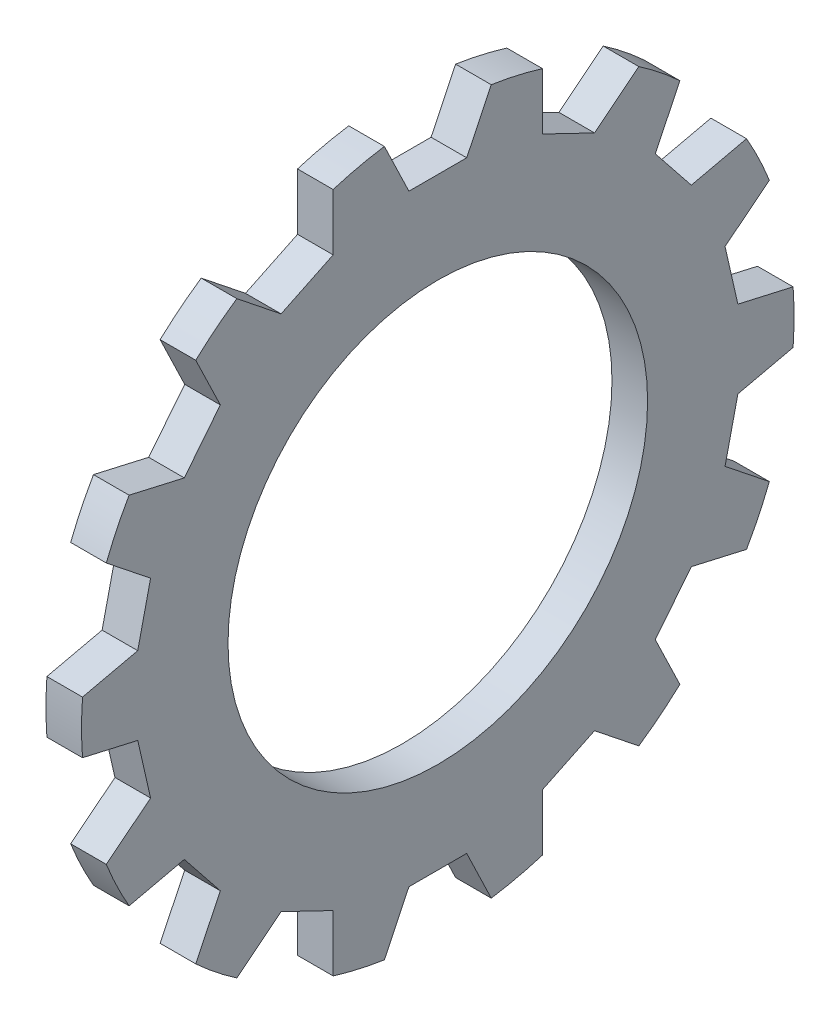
from build123d import *

# Parameters (mm, degrees)
SKETCH1_R          = 11.43
SKETCH1_R_2        = 6.731
BASE_EXTRUDE_DEPTH = 1.143
TYPEASLOT_DEPTH    = 17.204821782
TYPEAPATTERN_COUNT = 14


with BuildPart() as part:
    # Sketch1 → Base-Extrude (new body)
    with BuildSketch(Plane(origin=(0, 0, 0), x_dir=(0, 0, -1), z_dir=(1, 0, 0))):
        Circle(SKETCH1_R)
        Circle(SKETCH1_R_2, mode=Mode.SUBTRACT)
    extrude(amount=-BASE_EXTRUDE_DEPTH)

    # Sketch3 → TypeASlot (cut, through all)
    with BuildSketch(Plane(origin=(0, 0, 0), x_dir=(0, 0, -1), z_dir=(1, 0, 0))):
        Polygon((0.927060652, 9.663349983), (1.7145, 11.300680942), (1.7145, 12.329380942), (-1.7145, 12.329380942), (-1.7145, 11.300680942), (-0.927060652, 9.663349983), align=None)
    typeaslot = extrude(amount=-TYPEASLOT_DEPTH, mode=Mode.SUBTRACT)

    # TypeAPattern: TypeASlot ×14 about axis
    typeapattern_axis = Axis((0, 0, 0), (1, 0, 0))
    for i in range(1, TYPEAPATTERN_COUNT):
        add(typeaslot.rotate(typeapattern_axis, i * 360 / TYPEAPATTERN_COUNT), mode=Mode.SUBTRACT)


solid = part.part
